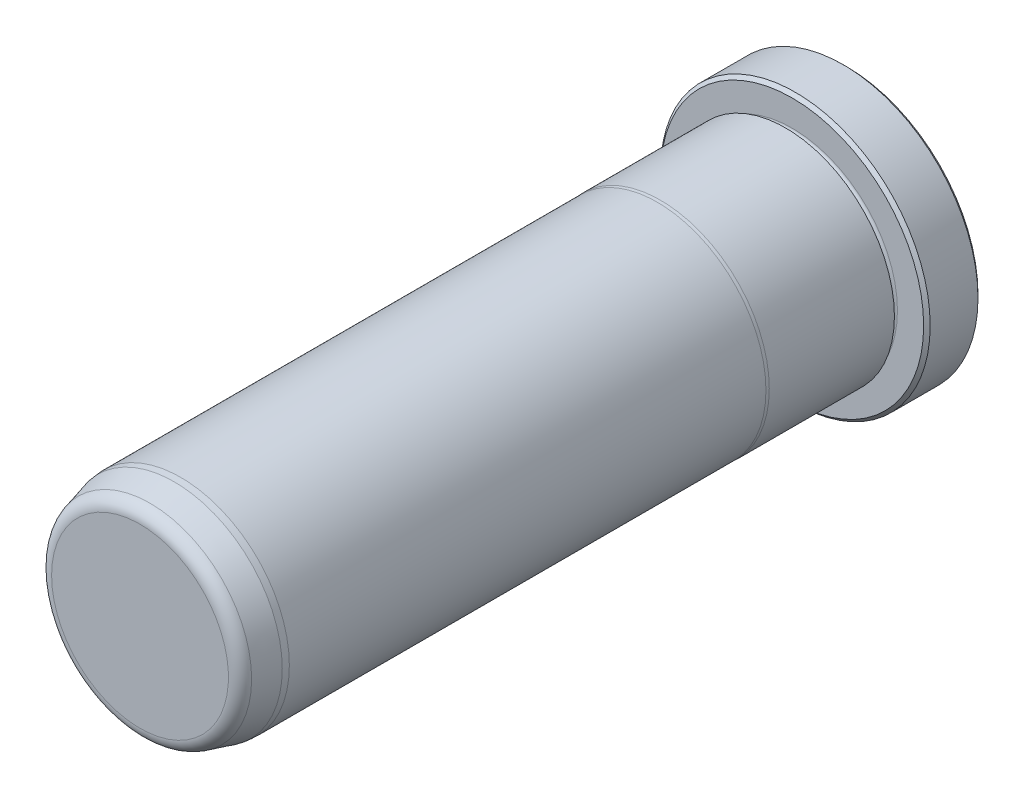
ISO-10303-21;
HEADER;
FILE_DESCRIPTION(('STEP AP214'),'2;1');
FILE_NAME('part.step','',(''),(''),'','','');
FILE_SCHEMA(('AUTOMOTIVE_DESIGN { 1 0 10303 214 1 1 1 1 }'));
ENDSEC;
DATA;
#1=APPLICATION_CONTEXT('core data for automotive mechanical design processes');
#2=APPLICATION_PROTOCOL_DEFINITION('international standard','automotive_design',2000,#1);
#3=PRODUCT_CONTEXT('',#1,'mechanical');
#4=PRODUCT('Part','Part','',(#3));
#5=PRODUCT_RELATED_PRODUCT_CATEGORY('part','',(#4));
#6=PRODUCT_DEFINITION_FORMATION('','',#4);
#7=PRODUCT_DEFINITION_CONTEXT('part definition',#1,'design');
#8=PRODUCT_DEFINITION('design','',#6,#7);
#9=PRODUCT_DEFINITION_SHAPE('','',#8);
#10=(LENGTH_UNIT() NAMED_UNIT(*) SI_UNIT(.MILLI.,.METRE.));
#11=(NAMED_UNIT(*) PLANE_ANGLE_UNIT() SI_UNIT($,.RADIAN.));
#12=(NAMED_UNIT(*) SI_UNIT($,.STERADIAN.) SOLID_ANGLE_UNIT());
#13=UNCERTAINTY_MEASURE_WITH_UNIT(LENGTH_MEASURE(1.E-05),#10,'distance_accuracy_value','');
#14=(GEOMETRIC_REPRESENTATION_CONTEXT(3) GLOBAL_UNCERTAINTY_ASSIGNED_CONTEXT((#13)) GLOBAL_UNIT_ASSIGNED_CONTEXT((#10,
#11,#12)) REPRESENTATION_CONTEXT('',''));
#15=CARTESIAN_POINT('',(0.,0.,0.));
#16=DIRECTION('',(0.,0.,1.));
#17=DIRECTION('',(1.,0.,0.));
#18=AXIS2_PLACEMENT_3D('',#15,#16,#17);
#19=CARTESIAN_POINT('',(0.,0.,0.));
#20=DIRECTION('',(0.,0.,1.));
#21=DIRECTION('',(1.,0.,0.));
#22=AXIS2_PLACEMENT_3D('',#19,#20,#21);
#23=PLANE('',#22);
#24=CARTESIAN_POINT('',(0.,0.,0.));
#25=DIRECTION('',(0.,0.,1.));
#26=DIRECTION('',(1.,0.,0.));
#27=AXIS2_PLACEMENT_3D('',#24,#25,#26);
#28=CIRCLE('',#27,15.367);
#29=CARTESIAN_POINT('',(15.367,0.,0.));
#30=VERTEX_POINT('',#29);
#31=EDGE_CURVE('E37',#30,#30,#28,.F.);
#32=ORIENTED_EDGE('',*,*,#31,.T.);
#33=EDGE_LOOP('',(#32));
#34=FACE_BOUND('',#33,.T.);
#35=ADVANCED_FACE('F30',(#34),#23,.F.);
#36=CARTESIAN_POINT('',(0.,0.,0.));
#37=DIRECTION('',(0.,0.,1.));
#38=DIRECTION('',(1.,0.,0.));
#39=AXIS2_PLACEMENT_3D('',#36,#37,#38);
#40=CYLINDRICAL_SURFACE('',#39,15.748);
#41=CARTESIAN_POINT('',(0.,0.,0.381000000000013));
#42=DIRECTION('',(0.,0.,1.));
#43=DIRECTION('',(1.,0.,0.));
#44=AXIS2_PLACEMENT_3D('',#41,#42,#43);
#45=CIRCLE('',#44,15.748);
#46=CARTESIAN_POINT('',(15.748,0.,0.381000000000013));
#47=VERTEX_POINT('',#46);
#48=EDGE_CURVE('E41',#47,#47,#45,.T.);
#49=ORIENTED_EDGE('',*,*,#48,.T.);
#50=EDGE_LOOP('',(#49));
#51=FACE_BOUND('',#50,.T.);
#52=CARTESIAN_POINT('',(0.,0.,5.96900000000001));
#53=DIRECTION('',(0.,0.,-1.));
#54=DIRECTION('',(-1.,0.,0.));
#55=AXIS2_PLACEMENT_3D('',#52,#53,#54);
#56=CIRCLE('',#55,15.748);
#57=CARTESIAN_POINT('',(-15.748,0.,5.96900000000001));
#58=VERTEX_POINT('',#57);
#59=EDGE_CURVE('E45',#58,#58,#56,.T.);
#60=ORIENTED_EDGE('',*,*,#59,.T.);
#61=EDGE_LOOP('',(#60));
#62=FACE_BOUND('',#61,.T.);
#63=ADVANCED_FACE('F118',(#51,#62),#40,.T.);
#64=CARTESIAN_POINT('',(0.,15.748,6.35));
#65=DIRECTION('',(0.,0.,-1.));
#66=DIRECTION('',(-1.,0.,0.));
#67=AXIS2_PLACEMENT_3D('',#64,#65,#66);
#68=PLANE('',#67);
#69=CARTESIAN_POINT('',(0.,0.,6.35));
#70=DIRECTION('',(0.,0.,-1.));
#71=DIRECTION('',(-1.,0.,0.));
#72=AXIS2_PLACEMENT_3D('',#69,#70,#71);
#73=CIRCLE('',#72,15.367);
#74=CARTESIAN_POINT('',(-15.367,0.,6.35));
#75=VERTEX_POINT('',#74);
#76=EDGE_CURVE('E10',#75,#75,#73,.F.);
#77=ORIENTED_EDGE('',*,*,#76,.T.);
#78=EDGE_LOOP('',(#77));
#79=FACE_BOUND('',#78,.T.);
#80=CARTESIAN_POINT('',(0.,0.,6.35));
#81=DIRECTION('',(0.,0.,1.));
#82=DIRECTION('',(1.,0.,0.));
#83=AXIS2_PLACEMENT_3D('',#80,#81,#82);
#84=CIRCLE('',#83,12.3063);
#85=CARTESIAN_POINT('',(12.3063,0.,6.35));
#86=VERTEX_POINT('',#85);
#87=EDGE_CURVE('E56',#86,#86,#84,.T.);
#88=ORIENTED_EDGE('',*,*,#87,.F.);
#89=EDGE_LOOP('',(#88));
#90=FACE_BOUND('',#89,.T.);
#91=ADVANCED_FACE('F113',(#79,#90),#68,.F.);
#92=CARTESIAN_POINT('',(0.,0.,6.731));
#93=DIRECTION('',(0.,0.,1.));
#94=DIRECTION('',(1.,0.,0.));
#95=AXIS2_PLACEMENT_3D('',#92,#93,#94);
#96=TOROIDAL_SURFACE('',#95,12.3063,0.381);
#97=CARTESIAN_POINT('',(0.,0.,7.112));
#98=DIRECTION('',(0.,0.,1.));
#99=DIRECTION('',(1.,0.,0.));
#100=AXIS2_PLACEMENT_3D('',#97,#98,#99);
#101=CIRCLE('',#100,12.3063);
#102=CARTESIAN_POINT('',(12.3063,0.,7.112));
#103=VERTEX_POINT('',#102);
#104=EDGE_CURVE('E59',#103,#103,#101,.T.);
#105=ORIENTED_EDGE('',*,*,#104,.F.);
#106=EDGE_LOOP('',(#105));
#107=FACE_BOUND('',#106,.T.);
#108=ORIENTED_EDGE('',*,*,#87,.T.);
#109=EDGE_LOOP('',(#108));
#110=FACE_BOUND('',#109,.T.);
#111=ADVANCED_FACE('F107',(#107,#110),#96,.F.);
#112=CARTESIAN_POINT('',(0.,12.3063,7.112));
#113=DIRECTION('',(0.,0.,1.));
#114=DIRECTION('',(1.,0.,0.));
#115=AXIS2_PLACEMENT_3D('',#112,#113,#114);
#116=PLANE('',#115);
#117=CARTESIAN_POINT('',(0.,0.,7.112));
#118=DIRECTION('',(0.,0.,1.));
#119=DIRECTION('',(1.,0.,0.));
#120=AXIS2_PLACEMENT_3D('',#117,#118,#119);
#121=CIRCLE('',#120,12.7127);
#122=CARTESIAN_POINT('',(12.7127,0.,7.112));
#123=VERTEX_POINT('',#122);
#124=EDGE_CURVE('E62',#123,#123,#121,.T.);
#125=ORIENTED_EDGE('',*,*,#124,.F.);
#126=EDGE_LOOP('',(#125));
#127=FACE_BOUND('',#126,.T.);
#128=ORIENTED_EDGE('',*,*,#104,.T.);
#129=EDGE_LOOP('',(#128));
#130=FACE_BOUND('',#129,.T.);
#131=ADVANCED_FACE('F101',(#127,#130),#116,.F.);
#132=CARTESIAN_POINT('',(0.,0.,0.));
#133=DIRECTION('',(0.,0.,1.));
#134=DIRECTION('',(1.,0.,0.));
#135=AXIS2_PLACEMENT_3D('',#132,#133,#134);
#136=CYLINDRICAL_SURFACE('',#135,12.7127);
#137=CARTESIAN_POINT('',(0.,0.,21.7347630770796));
#138=DIRECTION('',(0.,0.,1.));
#139=DIRECTION('',(1.,0.,0.));
#140=AXIS2_PLACEMENT_3D('',#137,#138,#139);
#141=CIRCLE('',#140,12.7127);
#142=CARTESIAN_POINT('',(12.7127,0.,21.7347630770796));
#143=VERTEX_POINT('',#142);
#144=EDGE_CURVE('E65',#143,#143,#141,.T.);
#145=ORIENTED_EDGE('',*,*,#144,.F.);
#146=EDGE_LOOP('',(#145));
#147=FACE_BOUND('',#146,.T.);
#148=ORIENTED_EDGE('',*,*,#124,.T.);
#149=EDGE_LOOP('',(#148));
#150=FACE_BOUND('',#149,.T.);
#151=ADVANCED_FACE('F95',(#147,#150),#136,.T.);
#152=CARTESIAN_POINT('',(0.,0.,21.7347630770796));
#153=DIRECTION('',(0.,0.,-1.));
#154=DIRECTION('',(-1.,0.,0.));
#155=AXIS2_PLACEMENT_3D('',#152,#153,#154);
#156=CONICAL_SURFACE('',#155,12.7127,0.069813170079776);
#157=CARTESIAN_POINT('',(0.,0.,22.098));
#158=DIRECTION('',(0.,0.,1.));
#159=DIRECTION('',(1.,0.,0.));
#160=AXIS2_PLACEMENT_3D('',#157,#158,#159);
#161=CIRCLE('',#160,12.6873);
#162=CARTESIAN_POINT('',(12.6873,0.,22.098));
#163=VERTEX_POINT('',#162);
#164=EDGE_CURVE('E68',#163,#163,#161,.T.);
#165=ORIENTED_EDGE('',*,*,#164,.F.);
#166=EDGE_LOOP('',(#165));
#167=FACE_BOUND('',#166,.T.);
#168=ORIENTED_EDGE('',*,*,#144,.T.);
#169=EDGE_LOOP('',(#168));
#170=FACE_BOUND('',#169,.T.);
#171=ADVANCED_FACE('F89',(#167,#170),#156,.T.);
#172=CARTESIAN_POINT('',(0.,0.,0.));
#173=DIRECTION('',(0.,0.,1.));
#174=DIRECTION('',(1.,0.,0.));
#175=AXIS2_PLACEMENT_3D('',#172,#173,#174);
#176=CYLINDRICAL_SURFACE('',#175,12.6873);
#177=CARTESIAN_POINT('',(0.,0.,77.7875));
#178=DIRECTION('',(0.,0.,1.));
#179=DIRECTION('',(1.,0.,0.));
#180=AXIS2_PLACEMENT_3D('',#177,#178,#179);
#181=CIRCLE('',#180,12.6873);
#182=CARTESIAN_POINT('',(12.6873,0.,77.7875));
#183=VERTEX_POINT('',#182);
#184=EDGE_CURVE('E71',#183,#183,#181,.T.);
#185=ORIENTED_EDGE('',*,*,#184,.F.);
#186=EDGE_LOOP('',(#185));
#187=FACE_BOUND('',#186,.T.);
#188=ORIENTED_EDGE('',*,*,#164,.T.);
#189=EDGE_LOOP('',(#188));
#190=FACE_BOUND('',#189,.T.);
#191=ADVANCED_FACE('F83',(#187,#190),#176,.T.);
#192=CARTESIAN_POINT('',(0.,0.,77.7875));
#193=DIRECTION('',(0.,0.,-1.));
#194=DIRECTION('',(-1.,0.,0.));
#195=AXIS2_PLACEMENT_3D('',#192,#193,#194);
#196=CONICAL_SURFACE('',#195,12.6873,0.0872664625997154);
#197=CARTESIAN_POINT('',(0.,0.,78.5495));
#198=DIRECTION('',(0.,0.,1.));
#199=DIRECTION('',(1.,0.,0.));
#200=AXIS2_PLACEMENT_3D('',#197,#198,#199);
#201=CIRCLE('',#200,12.6206336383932);
#202=CARTESIAN_POINT('',(12.6206336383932,0.,78.5495));
#203=VERTEX_POINT('',#202);
#204=EDGE_CURVE('E74',#203,#203,#201,.T.);
#205=ORIENTED_EDGE('',*,*,#204,.F.);
#206=EDGE_LOOP('',(#205));
#207=FACE_BOUND('',#206,.T.);
#208=ORIENTED_EDGE('',*,*,#184,.T.);
#209=EDGE_LOOP('',(#208));
#210=FACE_BOUND('',#209,.T.);
#211=ADVANCED_FACE('F80',(#207,#210),#196,.T.);
#212=CARTESIAN_POINT('',(0.,0.,78.5495));
#213=DIRECTION('',(0.,0.,-1.));
#214=DIRECTION('',(-1.,0.,0.));
#215=AXIS2_PLACEMENT_3D('',#212,#213,#214);
#216=CONICAL_SURFACE('',#215,12.6206336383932,0.261799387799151);
#217=CARTESIAN_POINT('',(0.,0.,81.3733752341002));
#218=DIRECTION('',(0.,0.,1.));
#219=DIRECTION('',(1.,0.,0.));
#220=AXIS2_PLACEMENT_3D('',#217,#218,#219);
#221=CIRCLE('',#220,11.8639785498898);
#222=CARTESIAN_POINT('',(11.8639785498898,0.,81.3733752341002));
#223=VERTEX_POINT('',#222);
#224=EDGE_CURVE('E50',#223,#223,#221,.F.);
#225=ORIENTED_EDGE('',*,*,#224,.T.);
#226=EDGE_LOOP('',(#225));
#227=FACE_BOUND('',#226,.T.);
#228=ORIENTED_EDGE('',*,*,#204,.T.);
#229=EDGE_LOOP('',(#228));
#230=FACE_BOUND('',#229,.T.);
#231=ADVANCED_FACE('F78',(#227,#230),#216,.T.);
#232=CARTESIAN_POINT('',(0.,11.5487028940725,82.55));
#233=DIRECTION('',(0.,0.,-1.));
#234=DIRECTION('',(-1.,0.,0.));
#235=AXIS2_PLACEMENT_3D('',#232,#233,#234);
#236=PLANE('',#235);
#237=CARTESIAN_POINT('',(0.,0.,82.55));
#238=DIRECTION('',(0.,0.,-1.));
#239=DIRECTION('',(-1.,0.,0.));
#240=AXIS2_PLACEMENT_3D('',#237,#238,#239);
#241=CIRCLE('',#240,10.3305713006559);
#242=CARTESIAN_POINT('',(-10.3305713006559,0.,82.55));
#243=VERTEX_POINT('',#242);
#244=EDGE_CURVE('E53',#243,#243,#241,.F.);
#245=ORIENTED_EDGE('',*,*,#244,.T.);
#246=EDGE_LOOP('',(#245));
#247=FACE_BOUND('',#246,.T.);
#248=ADVANCED_FACE('F133',(#247),#236,.F.);
#249=CARTESIAN_POINT('',(0.,0.,80.9625));
#250=DIRECTION('',(0.,0.,-1.));
#251=DIRECTION('',(-1.,0.,0.));
#252=AXIS2_PLACEMENT_3D('',#249,#250,#251);
#253=TOROIDAL_SURFACE('',#252,10.3305713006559,1.5875);
#254=ORIENTED_EDGE('',*,*,#224,.F.);
#255=EDGE_LOOP('',(#254));
#256=FACE_BOUND('',#255,.T.);
#257=ORIENTED_EDGE('',*,*,#244,.F.);
#258=EDGE_LOOP('',(#257));
#259=FACE_BOUND('',#258,.T.);
#260=ADVANCED_FACE('F130',(#256,#259),#253,.T.);
#261=CARTESIAN_POINT('',(0.,0.,0.381000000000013));
#262=DIRECTION('',(0.,0.,1.));
#263=DIRECTION('',(1.,0.,0.));
#264=AXIS2_PLACEMENT_3D('',#261,#262,#263);
#265=CONICAL_SURFACE('',#264,15.748,0.785398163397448);
#266=ORIENTED_EDGE('',*,*,#31,.F.);
#267=EDGE_LOOP('',(#266));
#268=FACE_BOUND('',#267,.T.);
#269=ORIENTED_EDGE('',*,*,#48,.F.);
#270=EDGE_LOOP('',(#269));
#271=FACE_BOUND('',#270,.T.);
#272=ADVANCED_FACE('F132',(#268,#271),#265,.T.);
#273=CARTESIAN_POINT('',(0.,0.,6.35));
#274=DIRECTION('',(0.,0.,-1.));
#275=DIRECTION('',(-1.,0.,0.));
#276=AXIS2_PLACEMENT_3D('',#273,#274,#275);
#277=CONICAL_SURFACE('',#276,15.367,0.78539816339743);
#278=ORIENTED_EDGE('',*,*,#59,.F.);
#279=EDGE_LOOP('',(#278));
#280=FACE_BOUND('',#279,.T.);
#281=ORIENTED_EDGE('',*,*,#76,.F.);
#282=EDGE_LOOP('',(#281));
#283=FACE_BOUND('',#282,.T.);
#284=ADVANCED_FACE('F32',(#280,#283),#277,.T.);
#285=CLOSED_SHELL('',(#35,#63,#91,#111,#131,#151,#171,#191,#211,#231,#248,#260,#272,#284));
#286=MANIFOLD_SOLID_BREP('B2',#285);
#287=ADVANCED_BREP_SHAPE_REPRESENTATION('',(#18,#286),#14);
#288=SHAPE_DEFINITION_REPRESENTATION(#9,#287);
ENDSEC;
END-ISO-10303-21;
